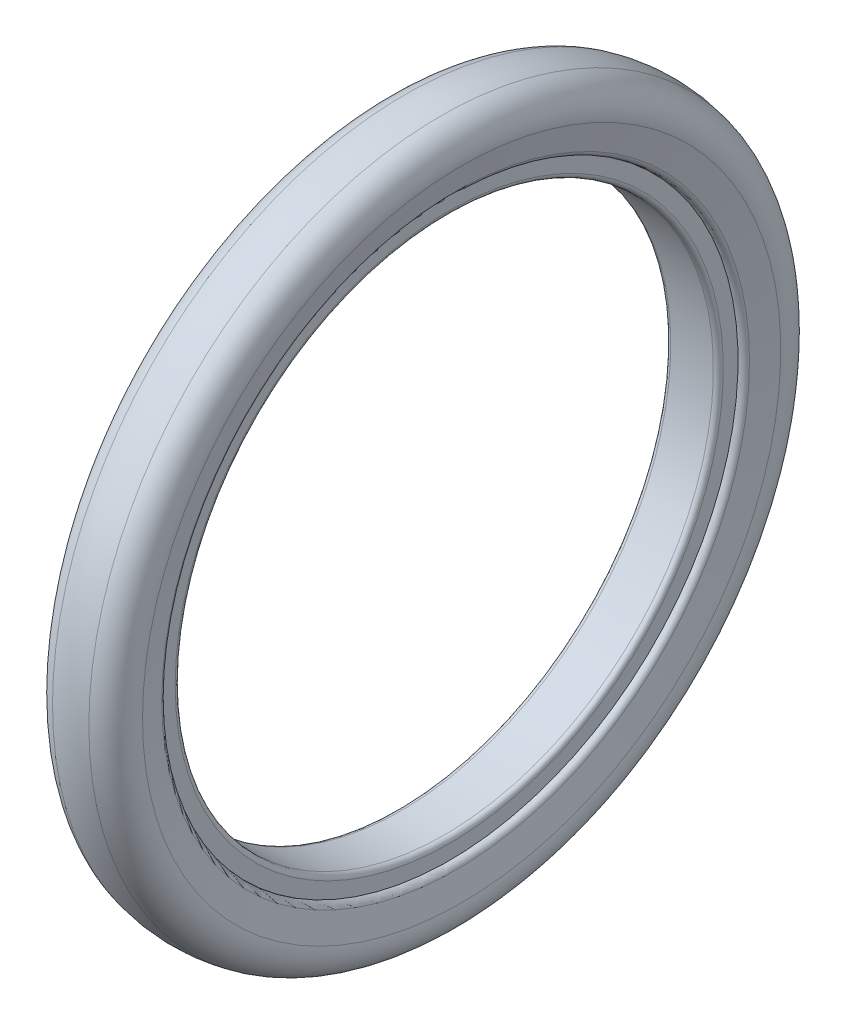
ISO-10303-21;
HEADER;
FILE_DESCRIPTION(('STEP AP214'),'2;1');
FILE_NAME('part.step','',(''),(''),'','','');
FILE_SCHEMA(('AUTOMOTIVE_DESIGN { 1 0 10303 214 1 1 1 1 }'));
ENDSEC;
DATA;
#1=APPLICATION_CONTEXT('core data for automotive mechanical design processes');
#2=APPLICATION_PROTOCOL_DEFINITION('international standard','automotive_design',2000,#1);
#3=PRODUCT_CONTEXT('',#1,'mechanical');
#4=PRODUCT('Part','Part','',(#3));
#5=PRODUCT_RELATED_PRODUCT_CATEGORY('part','',(#4));
#6=PRODUCT_DEFINITION_FORMATION('','',#4);
#7=PRODUCT_DEFINITION_CONTEXT('part definition',#1,'design');
#8=PRODUCT_DEFINITION('design','',#6,#7);
#9=PRODUCT_DEFINITION_SHAPE('','',#8);
#10=(LENGTH_UNIT() NAMED_UNIT(*) SI_UNIT(.MILLI.,.METRE.));
#11=(NAMED_UNIT(*) PLANE_ANGLE_UNIT() SI_UNIT($,.RADIAN.));
#12=(NAMED_UNIT(*) SI_UNIT($,.STERADIAN.) SOLID_ANGLE_UNIT());
#13=UNCERTAINTY_MEASURE_WITH_UNIT(LENGTH_MEASURE(1.E-05),#10,'distance_accuracy_value','');
#14=(GEOMETRIC_REPRESENTATION_CONTEXT(3) GLOBAL_UNCERTAINTY_ASSIGNED_CONTEXT((#13)) GLOBAL_UNIT_ASSIGNED_CONTEXT((#10,
#11,#12)) REPRESENTATION_CONTEXT('',''));
#15=CARTESIAN_POINT('',(0.,0.,0.));
#16=DIRECTION('',(0.,0.,1.));
#17=DIRECTION('',(1.,0.,0.));
#18=AXIS2_PLACEMENT_3D('',#15,#16,#17);
#19=CARTESIAN_POINT('',(25.4,0.,0.));
#20=DIRECTION('',(-1.,0.,0.));
#21=DIRECTION('',(0.,0.,1.));
#22=AXIS2_PLACEMENT_3D('',#19,#20,#21);
#23=TOROIDAL_SURFACE('',#22,285.75,6.34999999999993);
#24=CARTESIAN_POINT('',(25.4,0.,0.));
#25=DIRECTION('',(-1.,0.,0.));
#26=DIRECTION('',(0.,0.,1.));
#27=AXIS2_PLACEMENT_3D('',#24,#25,#26);
#28=CIRCLE('',#27,279.4);
#29=CARTESIAN_POINT('',(25.4,0.,279.4));
#30=VERTEX_POINT('',#29);
#31=EDGE_CURVE('E70',#30,#30,#28,.T.);
#32=ORIENTED_EDGE('',*,*,#31,.T.);
#33=EDGE_LOOP('',(#32));
#34=FACE_BOUND('',#33,.T.);
#35=CARTESIAN_POINT('',(31.5785027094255,0.,0.));
#36=DIRECTION('',(-1.,0.,0.));
#37=DIRECTION('',(0.,0.,1.));
#38=AXIS2_PLACEMENT_3D('',#35,#36,#37);
#39=CIRCLE('',#38,284.284188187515);
#40=CARTESIAN_POINT('',(31.5785027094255,0.,284.284188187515));
#41=VERTEX_POINT('',#40);
#42=EDGE_CURVE('E11',#41,#41,#39,.T.);
#43=ORIENTED_EDGE('',*,*,#42,.F.);
#44=EDGE_LOOP('',(#43));
#45=FACE_BOUND('',#44,.T.);
#46=ADVANCED_FACE('F42',(#34,#45),#23,.T.);
#47=CARTESIAN_POINT('',(37.3797113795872,0.,0.));
#48=DIRECTION('',(1.,0.,0.));
#49=DIRECTION('',(0.,0.,-1.));
#50=AXIS2_PLACEMENT_3D('',#47,#48,#49);
#51=CONICAL_SURFACE('',#50,308.736701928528,1.33785900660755);
#52=ORIENTED_EDGE('',*,*,#42,.T.);
#53=EDGE_LOOP('',(#52));
#54=FACE_BOUND('',#53,.T.);
#55=CARTESIAN_POINT('',(37.3797113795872,0.,0.));
#56=DIRECTION('',(-1.,0.,0.));
#57=DIRECTION('',(0.,0.,1.));
#58=AXIS2_PLACEMENT_3D('',#55,#56,#57);
#59=CIRCLE('',#58,308.736701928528);
#60=CARTESIAN_POINT('',(37.3797113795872,0.,308.736701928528));
#61=VERTEX_POINT('',#60);
#62=EDGE_CURVE('E48',#61,#61,#59,.T.);
#63=ORIENTED_EDGE('',*,*,#62,.F.);
#64=EDGE_LOOP('',(#63));
#65=FACE_BOUND('',#64,.T.);
#66=ADVANCED_FACE('F108',(#54,#65),#51,.F.);
#67=CARTESIAN_POINT('',(11.43,0.,0.));
#68=DIRECTION('',(-1.,0.,0.));
#69=DIRECTION('',(0.,0.,1.));
#70=AXIS2_PLACEMENT_3D('',#67,#68,#69);
#71=TOROIDAL_SURFACE('',#70,314.893111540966,26.67);
#72=ORIENTED_EDGE('',*,*,#62,.T.);
#73=EDGE_LOOP('',(#72));
#74=FACE_BOUND('',#73,.T.);
#75=CARTESIAN_POINT('',(17.5846153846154,0.,0.));
#76=DIRECTION('',(-1.,0.,0.));
#77=DIRECTION('',(0.,0.,1.));
#78=AXIS2_PLACEMENT_3D('',#75,#76,#77);
#79=CIRCLE('',#78,340.843248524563);
#80=CARTESIAN_POINT('',(17.5846153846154,0.,340.843248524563));
#81=VERTEX_POINT('',#80);
#82=EDGE_CURVE('E52',#81,#81,#79,.T.);
#83=ORIENTED_EDGE('',*,*,#82,.F.);
#84=EDGE_LOOP('',(#83));
#85=FACE_BOUND('',#84,.T.);
#86=ADVANCED_FACE('F103',(#74,#85),#71,.T.);
#87=CARTESIAN_POINT('',(0.,0.,0.));
#88=DIRECTION('',(-1.,0.,0.));
#89=DIRECTION('',(0.,0.,1.));
#90=AXIS2_PLACEMENT_3D('',#87,#88,#89);
#91=TOROIDAL_SURFACE('',#90,266.7,76.2);
#92=CARTESIAN_POINT('',(-17.5846153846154,0.,0.));
#93=DIRECTION('',(-1.,0.,0.));
#94=DIRECTION('',(0.,0.,1.));
#95=AXIS2_PLACEMENT_3D('',#92,#93,#94);
#96=CIRCLE('',#95,340.843248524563);
#97=CARTESIAN_POINT('',(-17.5846153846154,0.,340.843248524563));
#98=VERTEX_POINT('',#97);
#99=EDGE_CURVE('E56',#98,#98,#96,.T.);
#100=ORIENTED_EDGE('',*,*,#99,.F.);
#101=EDGE_LOOP('',(#100));
#102=FACE_BOUND('',#101,.T.);
#103=ORIENTED_EDGE('',*,*,#82,.T.);
#104=EDGE_LOOP('',(#103));
#105=FACE_BOUND('',#104,.T.);
#106=ADVANCED_FACE('F97',(#102,#105),#91,.T.);
#107=CARTESIAN_POINT('',(-11.43,0.,0.));
#108=DIRECTION('',(-1.,0.,0.));
#109=DIRECTION('',(0.,0.,1.));
#110=AXIS2_PLACEMENT_3D('',#107,#108,#109);
#111=TOROIDAL_SURFACE('',#110,314.893111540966,26.67);
#112=CARTESIAN_POINT('',(-37.3797113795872,0.,0.));
#113=DIRECTION('',(-1.,0.,0.));
#114=DIRECTION('',(0.,0.,1.));
#115=AXIS2_PLACEMENT_3D('',#112,#113,#114);
#116=CIRCLE('',#115,308.736701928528);
#117=CARTESIAN_POINT('',(-37.3797113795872,0.,308.736701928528));
#118=VERTEX_POINT('',#117);
#119=EDGE_CURVE('E61',#118,#118,#116,.T.);
#120=ORIENTED_EDGE('',*,*,#119,.F.);
#121=EDGE_LOOP('',(#120));
#122=FACE_BOUND('',#121,.T.);
#123=ORIENTED_EDGE('',*,*,#99,.T.);
#124=EDGE_LOOP('',(#123));
#125=FACE_BOUND('',#124,.T.);
#126=ADVANCED_FACE('F91',(#122,#125),#111,.T.);
#127=CARTESIAN_POINT('',(-37.3797113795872,0.,0.));
#128=DIRECTION('',(-1.,0.,0.));
#129=DIRECTION('',(0.,0.,1.));
#130=AXIS2_PLACEMENT_3D('',#127,#128,#129);
#131=CONICAL_SURFACE('',#130,308.736701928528,1.33785900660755);
#132=CARTESIAN_POINT('',(-31.5785027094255,0.,0.));
#133=DIRECTION('',(-1.,0.,0.));
#134=DIRECTION('',(0.,0.,1.));
#135=AXIS2_PLACEMENT_3D('',#132,#133,#134);
#136=CIRCLE('',#135,284.284188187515);
#137=CARTESIAN_POINT('',(-31.5785027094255,0.,284.284188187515));
#138=VERTEX_POINT('',#137);
#139=EDGE_CURVE('E64',#138,#138,#136,.T.);
#140=ORIENTED_EDGE('',*,*,#139,.F.);
#141=EDGE_LOOP('',(#140));
#142=FACE_BOUND('',#141,.T.);
#143=ORIENTED_EDGE('',*,*,#119,.T.);
#144=EDGE_LOOP('',(#143));
#145=FACE_BOUND('',#144,.T.);
#146=ADVANCED_FACE('F85',(#142,#145),#131,.F.);
#147=CARTESIAN_POINT('',(-25.4,0.,0.));
#148=DIRECTION('',(-1.,0.,0.));
#149=DIRECTION('',(0.,0.,1.));
#150=AXIS2_PLACEMENT_3D('',#147,#148,#149);
#151=TOROIDAL_SURFACE('',#150,285.75,6.34999999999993);
#152=CARTESIAN_POINT('',(-25.4,0.,0.));
#153=DIRECTION('',(-1.,0.,0.));
#154=DIRECTION('',(0.,0.,1.));
#155=AXIS2_PLACEMENT_3D('',#152,#153,#154);
#156=CIRCLE('',#155,279.4);
#157=CARTESIAN_POINT('',(-25.4,0.,279.4));
#158=VERTEX_POINT('',#157);
#159=EDGE_CURVE('E67',#158,#158,#156,.T.);
#160=ORIENTED_EDGE('',*,*,#159,.F.);
#161=EDGE_LOOP('',(#160));
#162=FACE_BOUND('',#161,.T.);
#163=ORIENTED_EDGE('',*,*,#139,.T.);
#164=EDGE_LOOP('',(#163));
#165=FACE_BOUND('',#164,.T.);
#166=ADVANCED_FACE('F79',(#162,#165),#151,.T.);
#167=CARTESIAN_POINT('',(0.,0.,0.));
#168=DIRECTION('',(-1.,0.,0.));
#169=DIRECTION('',(0.,0.,1.));
#170=AXIS2_PLACEMENT_3D('',#167,#168,#169);
#171=CYLINDRICAL_SURFACE('',#170,279.4);
#172=ORIENTED_EDGE('',*,*,#31,.F.);
#173=EDGE_LOOP('',(#172));
#174=FACE_BOUND('',#173,.T.);
#175=ORIENTED_EDGE('',*,*,#159,.T.);
#176=EDGE_LOOP('',(#175));
#177=FACE_BOUND('',#176,.T.);
#178=ADVANCED_FACE('F76',(#174,#177),#171,.F.);
#179=CLOSED_SHELL('',(#46,#66,#86,#106,#126,#146,#166,#178));
#180=MANIFOLD_SOLID_BREP('B2',#179);
#181=CARTESIAN_POINT('',(-25.4,0.,0.));
#182=DIRECTION('',(1.,0.,0.));
#183=DIRECTION('',(0.,0.,-1.));
#184=AXIS2_PLACEMENT_3D('',#181,#182,#183);
#185=PLANE('',#184);
#186=CARTESIAN_POINT('',(-25.4,0.,0.));
#187=DIRECTION('',(-1.,0.,0.));
#188=DIRECTION('',(0.,0.,1.));
#189=AXIS2_PLACEMENT_3D('',#186,#187,#188);
#190=CIRCLE('',#189,265.1252);
#191=CARTESIAN_POINT('',(-25.4,0.,265.1252));
#192=VERTEX_POINT('',#191);
#193=EDGE_CURVE('E41',#192,#192,#190,.T.);
#194=ORIENTED_EDGE('',*,*,#193,.F.);
#195=EDGE_LOOP('',(#194));
#196=FACE_BOUND('',#195,.T.);
#197=CARTESIAN_POINT('',(-25.4,0.,0.));
#198=DIRECTION('',(-1.,0.,0.));
#199=DIRECTION('',(0.,0.,1.));
#200=AXIS2_PLACEMENT_3D('',#197,#198,#199);
#201=CIRCLE('',#200,279.4);
#202=CARTESIAN_POINT('',(-25.4,0.,279.4));
#203=VERTEX_POINT('',#202);
#204=EDGE_CURVE('E185',#203,#203,#201,.T.);
#205=ORIENTED_EDGE('',*,*,#204,.T.);
#206=EDGE_LOOP('',(#205));
#207=FACE_BOUND('',#206,.T.);
#208=ADVANCED_FACE('F163',(#196,#207),#185,.F.);
#209=CARTESIAN_POINT('',(-20.6248,0.,0.));
#210=DIRECTION('',(-1.,0.,0.));
#211=DIRECTION('',(0.,0.,1.));
#212=AXIS2_PLACEMENT_3D('',#209,#210,#211);
#213=TOROIDAL_SURFACE('',#212,265.1252,4.77519999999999);
#214=CARTESIAN_POINT('',(-20.6248,0.,0.));
#215=DIRECTION('',(-1.,0.,0.));
#216=DIRECTION('',(0.,0.,1.));
#217=AXIS2_PLACEMENT_3D('',#214,#215,#216);
#218=CIRCLE('',#217,260.35);
#219=CARTESIAN_POINT('',(-20.6248,0.,260.35));
#220=VERTEX_POINT('',#219);
#221=EDGE_CURVE('E169',#220,#220,#218,.T.);
#222=ORIENTED_EDGE('',*,*,#221,.F.);
#223=EDGE_LOOP('',(#222));
#224=FACE_BOUND('',#223,.T.);
#225=ORIENTED_EDGE('',*,*,#193,.T.);
#226=EDGE_LOOP('',(#225));
#227=FACE_BOUND('',#226,.T.);
#228=ADVANCED_FACE('F202',(#224,#227),#213,.T.);
#229=CARTESIAN_POINT('',(0.,0.,0.));
#230=DIRECTION('',(-1.,0.,0.));
#231=DIRECTION('',(0.,0.,1.));
#232=AXIS2_PLACEMENT_3D('',#229,#230,#231);
#233=CYLINDRICAL_SURFACE('',#232,260.35);
#234=CARTESIAN_POINT('',(20.6248,0.,0.));
#235=DIRECTION('',(-1.,0.,0.));
#236=DIRECTION('',(0.,0.,1.));
#237=AXIS2_PLACEMENT_3D('',#234,#235,#236);
#238=CIRCLE('',#237,260.35);
#239=CARTESIAN_POINT('',(20.6248,0.,260.35));
#240=VERTEX_POINT('',#239);
#241=EDGE_CURVE('E173',#240,#240,#238,.T.);
#242=ORIENTED_EDGE('',*,*,#241,.F.);
#243=EDGE_LOOP('',(#242));
#244=FACE_BOUND('',#243,.T.);
#245=ORIENTED_EDGE('',*,*,#221,.T.);
#246=EDGE_LOOP('',(#245));
#247=FACE_BOUND('',#246,.T.);
#248=ADVANCED_FACE('F207',(#244,#247),#233,.F.);
#249=CARTESIAN_POINT('',(20.6248,0.,0.));
#250=DIRECTION('',(-1.,0.,0.));
#251=DIRECTION('',(0.,0.,1.));
#252=AXIS2_PLACEMENT_3D('',#249,#250,#251);
#253=TOROIDAL_SURFACE('',#252,265.1252,4.77519999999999);
#254=CARTESIAN_POINT('',(25.4,0.,0.));
#255=DIRECTION('',(-1.,0.,0.));
#256=DIRECTION('',(0.,0.,1.));
#257=AXIS2_PLACEMENT_3D('',#254,#255,#256);
#258=CIRCLE('',#257,265.1252);
#259=CARTESIAN_POINT('',(25.4,0.,265.1252));
#260=VERTEX_POINT('',#259);
#261=EDGE_CURVE('E177',#260,#260,#258,.T.);
#262=ORIENTED_EDGE('',*,*,#261,.F.);
#263=EDGE_LOOP('',(#262));
#264=FACE_BOUND('',#263,.T.);
#265=ORIENTED_EDGE('',*,*,#241,.T.);
#266=EDGE_LOOP('',(#265));
#267=FACE_BOUND('',#266,.T.);
#268=ADVANCED_FACE('F198',(#264,#267),#253,.T.);
#269=CARTESIAN_POINT('',(25.4,0.,0.));
#270=DIRECTION('',(-1.,0.,0.));
#271=DIRECTION('',(0.,0.,1.));
#272=AXIS2_PLACEMENT_3D('',#269,#270,#271);
#273=PLANE('',#272);
#274=CARTESIAN_POINT('',(25.4,0.,0.));
#275=DIRECTION('',(-1.,0.,0.));
#276=DIRECTION('',(0.,0.,1.));
#277=AXIS2_PLACEMENT_3D('',#274,#275,#276);
#278=CIRCLE('',#277,279.4);
#279=CARTESIAN_POINT('',(25.4,0.,279.4));
#280=VERTEX_POINT('',#279);
#281=EDGE_CURVE('E182',#280,#280,#278,.T.);
#282=ORIENTED_EDGE('',*,*,#281,.F.);
#283=EDGE_LOOP('',(#282));
#284=FACE_BOUND('',#283,.T.);
#285=ORIENTED_EDGE('',*,*,#261,.T.);
#286=EDGE_LOOP('',(#285));
#287=FACE_BOUND('',#286,.T.);
#288=ADVANCED_FACE('F192',(#284,#287),#273,.F.);
#289=CARTESIAN_POINT('',(0.,0.,0.));
#290=DIRECTION('',(-1.,0.,0.));
#291=DIRECTION('',(0.,0.,1.));
#292=AXIS2_PLACEMENT_3D('',#289,#290,#291);
#293=CYLINDRICAL_SURFACE('',#292,279.4);
#294=ORIENTED_EDGE('',*,*,#281,.T.);
#295=EDGE_LOOP('',(#294));
#296=FACE_BOUND('',#295,.T.);
#297=ORIENTED_EDGE('',*,*,#204,.F.);
#298=EDGE_LOOP('',(#297));
#299=FACE_BOUND('',#298,.T.);
#300=ADVANCED_FACE('F190',(#296,#299),#293,.T.);
#301=CLOSED_SHELL('',(#208,#228,#248,#268,#288,#300));
#302=MANIFOLD_SOLID_BREP('B6',#301);
#303=ADVANCED_BREP_SHAPE_REPRESENTATION('',(#18,#180,#302),#14);
#304=SHAPE_DEFINITION_REPRESENTATION(#9,#303);
ENDSEC;
END-ISO-10303-21;
